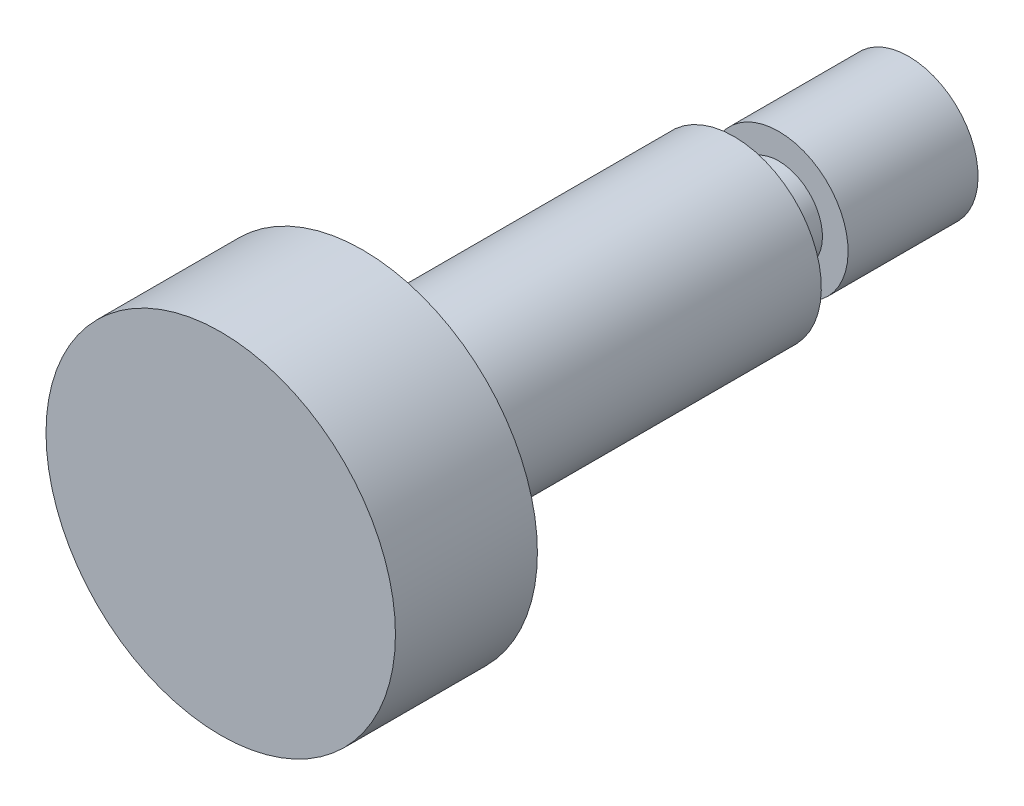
ISO-10303-21;
HEADER;
FILE_DESCRIPTION(('STEP AP214'),'2;1');
FILE_NAME('part.step','',(''),(''),'','','');
FILE_SCHEMA(('AUTOMOTIVE_DESIGN { 1 0 10303 214 1 1 1 1 }'));
ENDSEC;
DATA;
#1=APPLICATION_CONTEXT('core data for automotive mechanical design processes');
#2=APPLICATION_PROTOCOL_DEFINITION('international standard','automotive_design',2000,#1);
#3=PRODUCT_CONTEXT('',#1,'mechanical');
#4=PRODUCT('Part','Part','',(#3));
#5=PRODUCT_RELATED_PRODUCT_CATEGORY('part','',(#4));
#6=PRODUCT_DEFINITION_FORMATION('','',#4);
#7=PRODUCT_DEFINITION_CONTEXT('part definition',#1,'design');
#8=PRODUCT_DEFINITION('design','',#6,#7);
#9=PRODUCT_DEFINITION_SHAPE('','',#8);
#10=(LENGTH_UNIT() NAMED_UNIT(*) SI_UNIT(.MILLI.,.METRE.));
#11=(NAMED_UNIT(*) PLANE_ANGLE_UNIT() SI_UNIT($,.RADIAN.));
#12=(NAMED_UNIT(*) SI_UNIT($,.STERADIAN.) SOLID_ANGLE_UNIT());
#13=UNCERTAINTY_MEASURE_WITH_UNIT(LENGTH_MEASURE(1.E-05),#10,'distance_accuracy_value','');
#14=(GEOMETRIC_REPRESENTATION_CONTEXT(3) GLOBAL_UNCERTAINTY_ASSIGNED_CONTEXT((#13)) GLOBAL_UNIT_ASSIGNED_CONTEXT((#10,
#11,#12)) REPRESENTATION_CONTEXT('',''));
#15=CARTESIAN_POINT('',(0.,0.,0.));
#16=DIRECTION('',(0.,0.,1.));
#17=DIRECTION('',(1.,0.,0.));
#18=AXIS2_PLACEMENT_3D('',#15,#16,#17);
#19=CARTESIAN_POINT('',(0.,-8.,16.));
#20=DIRECTION('',(0.,0.,-1.));
#21=DIRECTION('',(0.,-1.,0.));
#22=AXIS2_PLACEMENT_3D('',#19,#20,#21);
#23=PLANE('',#22);
#24=CARTESIAN_POINT('',(0.,0.,16.));
#25=DIRECTION('',(0.,0.,1.));
#26=DIRECTION('',(0.,1.,0.));
#27=AXIS2_PLACEMENT_3D('',#24,#25,#26);
#28=CIRCLE('',#27,4.);
#29=CARTESIAN_POINT('',(0.,4.,16.));
#30=VERTEX_POINT('',#29);
#31=EDGE_CURVE('E40',#30,#30,#28,.T.);
#32=ORIENTED_EDGE('',*,*,#31,.T.);
#33=EDGE_LOOP('',(#32));
#34=FACE_BOUND('',#33,.T.);
#35=CARTESIAN_POINT('',(0.,0.,16.));
#36=DIRECTION('',(0.,0.,1.));
#37=DIRECTION('',(0.,1.,0.));
#38=AXIS2_PLACEMENT_3D('',#35,#36,#37);
#39=CIRCLE('',#38,8.);
#40=CARTESIAN_POINT('',(0.,8.,16.));
#41=VERTEX_POINT('',#40);
#42=EDGE_CURVE('E8',#41,#41,#39,.T.);
#43=ORIENTED_EDGE('',*,*,#42,.F.);
#44=EDGE_LOOP('',(#43));
#45=FACE_BOUND('',#44,.T.);
#46=ADVANCED_FACE('F12',(#34,#45),#23,.T.);
#47=CARTESIAN_POINT('',(0.,0.,20.));
#48=DIRECTION('',(0.,0.,1.));
#49=DIRECTION('',(0.,1.,0.));
#50=AXIS2_PLACEMENT_3D('',#47,#48,#49);
#51=CYLINDRICAL_SURFACE('',#50,8.);
#52=CARTESIAN_POINT('',(0.,0.,50.));
#53=DIRECTION('',(0.,0.,1.));
#54=DIRECTION('',(0.,1.,0.));
#55=AXIS2_PLACEMENT_3D('',#52,#53,#54);
#56=CIRCLE('',#55,8.);
#57=CARTESIAN_POINT('',(0.,8.,50.));
#58=VERTEX_POINT('',#57);
#59=EDGE_CURVE('E18',#58,#58,#56,.T.);
#60=ORIENTED_EDGE('',*,*,#59,.F.);
#61=EDGE_LOOP('',(#60));
#62=FACE_BOUND('',#61,.T.);
#63=ORIENTED_EDGE('',*,*,#42,.T.);
#64=EDGE_LOOP('',(#63));
#65=FACE_BOUND('',#64,.T.);
#66=ADVANCED_FACE('F59',(#62,#65),#51,.T.);
#67=CARTESIAN_POINT('',(0.,-16.,50.));
#68=DIRECTION('',(0.,0.,-1.));
#69=DIRECTION('',(0.,-1.,0.));
#70=AXIS2_PLACEMENT_3D('',#67,#68,#69);
#71=PLANE('',#70);
#72=ORIENTED_EDGE('',*,*,#59,.T.);
#73=EDGE_LOOP('',(#72));
#74=FACE_BOUND('',#73,.T.);
#75=CARTESIAN_POINT('',(0.,0.,50.));
#76=DIRECTION('',(0.,0.,1.));
#77=DIRECTION('',(0.,1.,0.));
#78=AXIS2_PLACEMENT_3D('',#75,#76,#77);
#79=CIRCLE('',#78,16.);
#80=CARTESIAN_POINT('',(0.,16.,50.));
#81=VERTEX_POINT('',#80);
#82=EDGE_CURVE('E22',#81,#81,#79,.T.);
#83=ORIENTED_EDGE('',*,*,#82,.F.);
#84=EDGE_LOOP('',(#83));
#85=FACE_BOUND('',#84,.T.);
#86=ADVANCED_FACE('F63',(#74,#85),#71,.T.);
#87=CARTESIAN_POINT('',(0.,0.,20.));
#88=DIRECTION('',(0.,0.,1.));
#89=DIRECTION('',(0.,1.,0.));
#90=AXIS2_PLACEMENT_3D('',#87,#88,#89);
#91=CYLINDRICAL_SURFACE('',#90,16.);
#92=CARTESIAN_POINT('',(0.,0.,63.));
#93=DIRECTION('',(0.,0.,1.));
#94=DIRECTION('',(0.,1.,0.));
#95=AXIS2_PLACEMENT_3D('',#92,#93,#94);
#96=CIRCLE('',#95,16.);
#97=CARTESIAN_POINT('',(0.,16.,63.));
#98=VERTEX_POINT('',#97);
#99=EDGE_CURVE('E26',#98,#98,#96,.T.);
#100=ORIENTED_EDGE('',*,*,#99,.F.);
#101=EDGE_LOOP('',(#100));
#102=FACE_BOUND('',#101,.T.);
#103=ORIENTED_EDGE('',*,*,#82,.T.);
#104=EDGE_LOOP('',(#103));
#105=FACE_BOUND('',#104,.T.);
#106=ADVANCED_FACE('F68',(#102,#105),#91,.T.);
#107=CARTESIAN_POINT('',(0.,-16.,63.));
#108=DIRECTION('',(0.,0.,-1.));
#109=DIRECTION('',(0.,-1.,0.));
#110=AXIS2_PLACEMENT_3D('',#107,#108,#109);
#111=PLANE('',#110);
#112=ORIENTED_EDGE('',*,*,#99,.T.);
#113=EDGE_LOOP('',(#112));
#114=FACE_BOUND('',#113,.T.);
#115=ADVANCED_FACE('F73',(#114),#111,.F.);
#116=CARTESIAN_POINT('',(0.,-6.35,0.));
#117=DIRECTION('',(0.,0.,-1.));
#118=DIRECTION('',(0.,-1.,0.));
#119=AXIS2_PLACEMENT_3D('',#116,#117,#118);
#120=PLANE('',#119);
#121=CARTESIAN_POINT('',(0.,0.,0.));
#122=DIRECTION('',(0.,0.,1.));
#123=DIRECTION('',(0.,1.,0.));
#124=AXIS2_PLACEMENT_3D('',#121,#122,#123);
#125=CIRCLE('',#124,6.35);
#126=CARTESIAN_POINT('',(0.,6.35,0.));
#127=VERTEX_POINT('',#126);
#128=EDGE_CURVE('E31',#127,#127,#125,.T.);
#129=ORIENTED_EDGE('',*,*,#128,.F.);
#130=EDGE_LOOP('',(#129));
#131=FACE_BOUND('',#130,.T.);
#132=ADVANCED_FACE('F77',(#131),#120,.T.);
#133=CARTESIAN_POINT('',(0.,0.,20.));
#134=DIRECTION('',(0.,0.,1.));
#135=DIRECTION('',(0.,1.,0.));
#136=AXIS2_PLACEMENT_3D('',#133,#134,#135);
#137=CYLINDRICAL_SURFACE('',#136,6.35);
#138=ORIENTED_EDGE('',*,*,#128,.T.);
#139=EDGE_LOOP('',(#138));
#140=FACE_BOUND('',#139,.T.);
#141=CARTESIAN_POINT('',(0.,0.,11.9));
#142=DIRECTION('',(0.,0.,1.));
#143=DIRECTION('',(0.,1.,0.));
#144=AXIS2_PLACEMENT_3D('',#141,#142,#143);
#145=CIRCLE('',#144,6.35);
#146=CARTESIAN_POINT('',(0.,6.35,11.9));
#147=VERTEX_POINT('',#146);
#148=EDGE_CURVE('E34',#147,#147,#145,.T.);
#149=ORIENTED_EDGE('',*,*,#148,.F.);
#150=EDGE_LOOP('',(#149));
#151=FACE_BOUND('',#150,.T.);
#152=ADVANCED_FACE('F55',(#140,#151),#137,.T.);
#153=CARTESIAN_POINT('',(0.,-4.,11.9));
#154=DIRECTION('',(0.,0.,1.));
#155=DIRECTION('',(0.,1.,0.));
#156=AXIS2_PLACEMENT_3D('',#153,#154,#155);
#157=PLANE('',#156);
#158=ORIENTED_EDGE('',*,*,#148,.T.);
#159=EDGE_LOOP('',(#158));
#160=FACE_BOUND('',#159,.T.);
#161=CARTESIAN_POINT('',(0.,0.,11.9));
#162=DIRECTION('',(0.,0.,1.));
#163=DIRECTION('',(0.,1.,0.));
#164=AXIS2_PLACEMENT_3D('',#161,#162,#163);
#165=CIRCLE('',#164,4.);
#166=CARTESIAN_POINT('',(0.,4.,11.9));
#167=VERTEX_POINT('',#166);
#168=EDGE_CURVE('E37',#167,#167,#165,.T.);
#169=ORIENTED_EDGE('',*,*,#168,.F.);
#170=EDGE_LOOP('',(#169));
#171=FACE_BOUND('',#170,.T.);
#172=ADVANCED_FACE('F48',(#160,#171),#157,.T.);
#173=CARTESIAN_POINT('',(0.,0.,20.));
#174=DIRECTION('',(0.,0.,1.));
#175=DIRECTION('',(0.,1.,0.));
#176=AXIS2_PLACEMENT_3D('',#173,#174,#175);
#177=CYLINDRICAL_SURFACE('',#176,4.);
#178=ORIENTED_EDGE('',*,*,#168,.T.);
#179=EDGE_LOOP('',(#178));
#180=FACE_BOUND('',#179,.T.);
#181=ORIENTED_EDGE('',*,*,#31,.F.);
#182=EDGE_LOOP('',(#181));
#183=FACE_BOUND('',#182,.T.);
#184=ADVANCED_FACE('F46',(#180,#183),#177,.T.);
#185=CLOSED_SHELL('',(#46,#66,#86,#106,#115,#132,#152,#172,#184));
#186=MANIFOLD_SOLID_BREP('B1',#185);
#187=ADVANCED_BREP_SHAPE_REPRESENTATION('',(#18,#186),#14);
#188=SHAPE_DEFINITION_REPRESENTATION(#9,#187);
ENDSEC;
END-ISO-10303-21;
